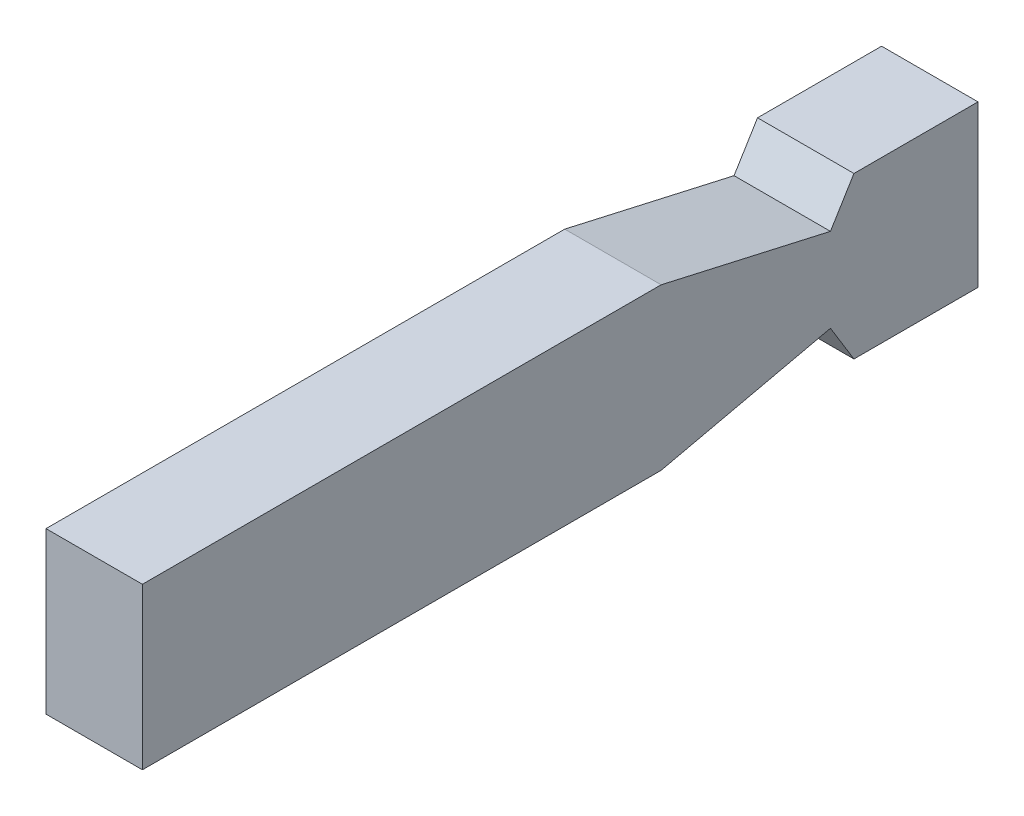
ISO-10303-21;
HEADER;
FILE_DESCRIPTION(('STEP AP214'),'2;1');
FILE_NAME('part.step','',(''),(''),'','','');
FILE_SCHEMA(('AUTOMOTIVE_DESIGN { 1 0 10303 214 1 1 1 1 }'));
ENDSEC;
DATA;
#1=APPLICATION_CONTEXT('core data for automotive mechanical design processes');
#2=APPLICATION_PROTOCOL_DEFINITION('international standard','automotive_design',2000,#1);
#3=PRODUCT_CONTEXT('',#1,'mechanical');
#4=PRODUCT('Part','Part','',(#3));
#5=PRODUCT_RELATED_PRODUCT_CATEGORY('part','',(#4));
#6=PRODUCT_DEFINITION_FORMATION('','',#4);
#7=PRODUCT_DEFINITION_CONTEXT('part definition',#1,'design');
#8=PRODUCT_DEFINITION('design','',#6,#7);
#9=PRODUCT_DEFINITION_SHAPE('','',#8);
#10=(LENGTH_UNIT() NAMED_UNIT(*) SI_UNIT(.MILLI.,.METRE.));
#11=(NAMED_UNIT(*) PLANE_ANGLE_UNIT() SI_UNIT($,.RADIAN.));
#12=(NAMED_UNIT(*) SI_UNIT($,.STERADIAN.) SOLID_ANGLE_UNIT());
#13=UNCERTAINTY_MEASURE_WITH_UNIT(LENGTH_MEASURE(1.E-05),#10,'distance_accuracy_value','');
#14=(GEOMETRIC_REPRESENTATION_CONTEXT(3) GLOBAL_UNCERTAINTY_ASSIGNED_CONTEXT((#13)) GLOBAL_UNIT_ASSIGNED_CONTEXT((#10,
#11,#12)) REPRESENTATION_CONTEXT('',''));
#15=CARTESIAN_POINT('',(0.,0.,0.));
#16=DIRECTION('',(0.,0.,1.));
#17=DIRECTION('',(1.,0.,0.));
#18=AXIS2_PLACEMENT_3D('',#15,#16,#17);
#19=CARTESIAN_POINT('',(0.,0.,130.));
#20=DIRECTION('',(0.,1.,0.));
#21=DIRECTION('',(0.,0.,1.));
#22=AXIS2_PLACEMENT_3D('',#19,#20,#21);
#23=PLANE('',#22);
#24=DIRECTION('',(0.,0.,-1.));
#25=VECTOR('',#24,1.);
#26=CARTESIAN_POINT('',(15.,0.,130.));
#27=LINE('',#26,#25);
#28=CARTESIAN_POINT('',(15.,0.,19.3));
#29=VERTEX_POINT('',#28);
#30=CARTESIAN_POINT('',(15.,0.,0.));
#31=VERTEX_POINT('',#30);
#32=EDGE_CURVE('E150',#29,#31,#27,.T.);
#33=ORIENTED_EDGE('',*,*,#32,.F.);
#34=DIRECTION('',(-1.,0.,0.));
#35=VECTOR('',#34,1.);
#36=CARTESIAN_POINT('',(15.,0.,19.3));
#37=LINE('',#36,#35);
#38=CARTESIAN_POINT('',(0.,0.,19.3));
#39=VERTEX_POINT('',#38);
#40=EDGE_CURVE('E186',#29,#39,#37,.T.);
#41=ORIENTED_EDGE('',*,*,#40,.T.);
#42=DIRECTION('',(0.,0.,-1.));
#43=VECTOR('',#42,1.);
#44=CARTESIAN_POINT('',(0.,0.,130.));
#45=LINE('',#44,#43);
#46=CARTESIAN_POINT('',(0.,0.,0.));
#47=VERTEX_POINT('',#46);
#48=EDGE_CURVE('E34',#39,#47,#45,.T.);
#49=ORIENTED_EDGE('',*,*,#48,.T.);
#50=DIRECTION('',(1.,0.,0.));
#51=VECTOR('',#50,1.);
#52=CARTESIAN_POINT('',(0.,0.,0.));
#53=LINE('',#52,#51);
#54=EDGE_CURVE('E162',#47,#31,#53,.T.);
#55=ORIENTED_EDGE('',*,*,#54,.T.);
#56=EDGE_LOOP('',(#33,#41,#49,#55));
#57=FACE_BOUND('',#56,.T.);
#58=ADVANCED_FACE('F26',(#57),#23,.F.);
#59=CARTESIAN_POINT('',(0.,25.,130.));
#60=DIRECTION('',(0.,-1.,0.));
#61=DIRECTION('',(0.,0.,-1.));
#62=AXIS2_PLACEMENT_3D('',#59,#60,#61);
#63=PLANE('',#62);
#64=DIRECTION('',(0.,0.,-1.));
#65=VECTOR('',#64,1.);
#66=CARTESIAN_POINT('',(15.,25.,130.));
#67=LINE('',#66,#65);
#68=CARTESIAN_POINT('',(15.,25.,130.));
#69=VERTEX_POINT('',#68);
#70=CARTESIAN_POINT('',(15.,25.,49.3));
#71=VERTEX_POINT('',#70);
#72=EDGE_CURVE('E148',#69,#71,#67,.T.);
#73=ORIENTED_EDGE('',*,*,#72,.T.);
#74=DIRECTION('',(-1.,0.,0.));
#75=VECTOR('',#74,1.);
#76=CARTESIAN_POINT('',(15.,25.,49.3));
#77=LINE('',#76,#75);
#78=CARTESIAN_POINT('',(0.,25.,49.3));
#79=VERTEX_POINT('',#78);
#80=EDGE_CURVE('E172',#71,#79,#77,.T.);
#81=ORIENTED_EDGE('',*,*,#80,.T.);
#82=DIRECTION('',(0.,0.,-1.));
#83=VECTOR('',#82,1.);
#84=CARTESIAN_POINT('',(0.,25.,130.));
#85=LINE('',#84,#83);
#86=CARTESIAN_POINT('',(0.,25.,130.));
#87=VERTEX_POINT('',#86);
#88=EDGE_CURVE('E145',#87,#79,#85,.T.);
#89=ORIENTED_EDGE('',*,*,#88,.F.);
#90=DIRECTION('',(-1.,0.,0.));
#91=VECTOR('',#90,1.);
#92=CARTESIAN_POINT('',(0.,25.,130.));
#93=LINE('',#92,#91);
#94=EDGE_CURVE('E132',#69,#87,#93,.T.);
#95=ORIENTED_EDGE('',*,*,#94,.F.);
#96=EDGE_LOOP('',(#73,#81,#89,#95));
#97=FACE_BOUND('',#96,.T.);
#98=ADVANCED_FACE('F202',(#97),#63,.F.);
#99=CARTESIAN_POINT('',(0.,0.,130.));
#100=DIRECTION('',(1.,0.,0.));
#101=DIRECTION('',(0.,0.,-1.));
#102=AXIS2_PLACEMENT_3D('',#99,#100,#101);
#103=PLANE('',#102);
#104=ORIENTED_EDGE('',*,*,#48,.F.);
#105=DIRECTION('',(0.,-0.852923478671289,-0.522035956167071));
#106=VECTOR('',#105,1.);
#107=CARTESIAN_POINT('',(0.,0.,19.3));
#108=LINE('',#107,#106);
#109=CARTESIAN_POINT('',(0.,5.97046435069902,22.9542516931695));
#110=VERTEX_POINT('',#109);
#111=EDGE_CURVE('E119',#110,#39,#108,.T.);
#112=ORIENTED_EDGE('',*,*,#111,.F.);
#113=DIRECTION('',(0.,0.221015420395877,-0.975270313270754));
#114=VECTOR('',#113,1.);
#115=CARTESIAN_POINT('',(0.,5.97046435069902,22.9542516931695));
#116=LINE('',#115,#114);
#117=CARTESIAN_POINT('',(0.,0.,49.3));
#118=VERTEX_POINT('',#117);
#119=EDGE_CURVE('E106',#118,#110,#116,.T.);
#120=ORIENTED_EDGE('',*,*,#119,.F.);
#121=CARTESIAN_POINT('',(0.,0.,130.));
#122=VERTEX_POINT('',#121);
#123=EDGE_CURVE('E11',#122,#118,#45,.T.);
#124=ORIENTED_EDGE('',*,*,#123,.F.);
#125=DIRECTION('',(0.,-1.,0.));
#126=VECTOR('',#125,1.);
#127=CARTESIAN_POINT('',(0.,0.,130.));
#128=LINE('',#127,#126);
#129=EDGE_CURVE('E128',#87,#122,#128,.T.);
#130=ORIENTED_EDGE('',*,*,#129,.F.);
#131=ORIENTED_EDGE('',*,*,#88,.T.);
#132=DIRECTION('',(0.,0.221015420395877,0.975270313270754));
#133=VECTOR('',#132,1.);
#134=CARTESIAN_POINT('',(0.,19.029535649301,22.9542516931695));
#135=LINE('',#134,#133);
#136=CARTESIAN_POINT('',(0.,19.029535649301,22.9542516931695));
#137=VERTEX_POINT('',#136);
#138=EDGE_CURVE('E185',#137,#79,#135,.T.);
#139=ORIENTED_EDGE('',*,*,#138,.F.);
#140=DIRECTION('',(0.,-0.852923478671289,0.522035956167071));
#141=VECTOR('',#140,1.);
#142=CARTESIAN_POINT('',(0.,25.,19.3));
#143=LINE('',#142,#141);
#144=CARTESIAN_POINT('',(0.,25.,19.3));
#145=VERTEX_POINT('',#144);
#146=EDGE_CURVE('E182',#145,#137,#143,.T.);
#147=ORIENTED_EDGE('',*,*,#146,.F.);
#148=CARTESIAN_POINT('',(0.,25.,0.));
#149=VERTEX_POINT('',#148);
#150=EDGE_CURVE('E144',#145,#149,#85,.T.);
#151=ORIENTED_EDGE('',*,*,#150,.T.);
#152=DIRECTION('',(0.,-1.,0.));
#153=VECTOR('',#152,1.);
#154=CARTESIAN_POINT('',(0.,0.,0.));
#155=LINE('',#154,#153);
#156=EDGE_CURVE('E166',#149,#47,#155,.T.);
#157=ORIENTED_EDGE('',*,*,#156,.T.);
#158=EDGE_LOOP('',(#104,#112,#120,#124,#130,#131,#139,#147,#151,#157));
#159=FACE_BOUND('',#158,.T.);
#160=ADVANCED_FACE('F28',(#159),#103,.F.);
#161=ORIENTED_EDGE('',*,*,#123,.T.);
#162=DIRECTION('',(-1.,0.,0.));
#163=VECTOR('',#162,1.);
#164=CARTESIAN_POINT('',(15.,0.,49.3));
#165=LINE('',#164,#163);
#166=CARTESIAN_POINT('',(15.,0.,49.3));
#167=VERTEX_POINT('',#166);
#168=EDGE_CURVE('E103',#167,#118,#165,.T.);
#169=ORIENTED_EDGE('',*,*,#168,.F.);
#170=CARTESIAN_POINT('',(15.,0.,130.));
#171=VERTEX_POINT('',#170);
#172=EDGE_CURVE('E124',#171,#167,#27,.T.);
#173=ORIENTED_EDGE('',*,*,#172,.F.);
#174=DIRECTION('',(1.,0.,0.));
#175=VECTOR('',#174,1.);
#176=CARTESIAN_POINT('',(0.,0.,130.));
#177=LINE('',#176,#175);
#178=EDGE_CURVE('E122',#122,#171,#177,.T.);
#179=ORIENTED_EDGE('',*,*,#178,.F.);
#180=EDGE_LOOP('',(#161,#169,#173,#179));
#181=FACE_BOUND('',#180,.T.);
#182=ADVANCED_FACE('F121',(#181),#23,.F.);
#183=CARTESIAN_POINT('',(15.,0.,130.));
#184=DIRECTION('',(-1.,0.,0.));
#185=DIRECTION('',(0.,0.,1.));
#186=AXIS2_PLACEMENT_3D('',#183,#184,#185);
#187=PLANE('',#186);
#188=DIRECTION('',(0.,0.221015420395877,-0.975270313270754));
#189=VECTOR('',#188,1.);
#190=CARTESIAN_POINT('',(15.,5.97046435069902,22.9542516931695));
#191=LINE('',#190,#189);
#192=CARTESIAN_POINT('',(15.,5.97046435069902,22.9542516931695));
#193=VERTEX_POINT('',#192);
#194=EDGE_CURVE('E109',#167,#193,#191,.T.);
#195=ORIENTED_EDGE('',*,*,#194,.T.);
#196=DIRECTION('',(0.,-0.852923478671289,-0.522035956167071));
#197=VECTOR('',#196,1.);
#198=CARTESIAN_POINT('',(15.,0.,19.3));
#199=LINE('',#198,#197);
#200=EDGE_CURVE('E41',#193,#29,#199,.T.);
#201=ORIENTED_EDGE('',*,*,#200,.T.);
#202=ORIENTED_EDGE('',*,*,#32,.T.);
#203=DIRECTION('',(0.,1.,0.));
#204=VECTOR('',#203,1.);
#205=CARTESIAN_POINT('',(15.,0.,0.));
#206=LINE('',#205,#204);
#207=CARTESIAN_POINT('',(15.,25.,0.));
#208=VERTEX_POINT('',#207);
#209=EDGE_CURVE('E138',#31,#208,#206,.T.);
#210=ORIENTED_EDGE('',*,*,#209,.T.);
#211=CARTESIAN_POINT('',(15.,25.,19.3));
#212=VERTEX_POINT('',#211);
#213=EDGE_CURVE('E147',#212,#208,#67,.T.);
#214=ORIENTED_EDGE('',*,*,#213,.F.);
#215=DIRECTION('',(0.,-0.852923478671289,0.522035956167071));
#216=VECTOR('',#215,1.);
#217=CARTESIAN_POINT('',(15.,25.,19.3));
#218=LINE('',#217,#216);
#219=CARTESIAN_POINT('',(15.,19.029535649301,22.9542516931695));
#220=VERTEX_POINT('',#219);
#221=EDGE_CURVE('E49',#212,#220,#218,.T.);
#222=ORIENTED_EDGE('',*,*,#221,.T.);
#223=DIRECTION('',(0.,0.221015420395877,0.975270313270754));
#224=VECTOR('',#223,1.);
#225=CARTESIAN_POINT('',(15.,19.029535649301,22.9542516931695));
#226=LINE('',#225,#224);
#227=EDGE_CURVE('E179',#220,#71,#226,.T.);
#228=ORIENTED_EDGE('',*,*,#227,.T.);
#229=ORIENTED_EDGE('',*,*,#72,.F.);
#230=DIRECTION('',(0.,1.,0.));
#231=VECTOR('',#230,1.);
#232=CARTESIAN_POINT('',(15.,0.,130.));
#233=LINE('',#232,#231);
#234=EDGE_CURVE('E127',#171,#69,#233,.T.);
#235=ORIENTED_EDGE('',*,*,#234,.F.);
#236=ORIENTED_EDGE('',*,*,#172,.T.);
#237=EDGE_LOOP('',(#195,#201,#202,#210,#214,#222,#228,#229,#235,#236));
#238=FACE_BOUND('',#237,.T.);
#239=ADVANCED_FACE('F155',(#238),#187,.F.);
#240=ORIENTED_EDGE('',*,*,#150,.F.);
#241=DIRECTION('',(-1.,0.,0.));
#242=VECTOR('',#241,1.);
#243=CARTESIAN_POINT('',(15.,25.,19.3));
#244=LINE('',#243,#242);
#245=EDGE_CURVE('E175',#212,#145,#244,.T.);
#246=ORIENTED_EDGE('',*,*,#245,.F.);
#247=ORIENTED_EDGE('',*,*,#213,.T.);
#248=DIRECTION('',(-1.,0.,0.));
#249=VECTOR('',#248,1.);
#250=CARTESIAN_POINT('',(0.,25.,0.));
#251=LINE('',#250,#249);
#252=EDGE_CURVE('E135',#208,#149,#251,.T.);
#253=ORIENTED_EDGE('',*,*,#252,.T.);
#254=EDGE_LOOP('',(#240,#246,#247,#253));
#255=FACE_BOUND('',#254,.T.);
#256=ADVANCED_FACE('F197',(#255),#63,.F.);
#257=CARTESIAN_POINT('',(0.,25.,130.));
#258=DIRECTION('',(0.,0.,-1.));
#259=DIRECTION('',(-1.,0.,0.));
#260=AXIS2_PLACEMENT_3D('',#257,#258,#259);
#261=PLANE('',#260);
#262=ORIENTED_EDGE('',*,*,#129,.T.);
#263=ORIENTED_EDGE('',*,*,#178,.T.);
#264=ORIENTED_EDGE('',*,*,#234,.T.);
#265=ORIENTED_EDGE('',*,*,#94,.T.);
#266=EDGE_LOOP('',(#262,#263,#264,#265));
#267=FACE_BOUND('',#266,.T.);
#268=ADVANCED_FACE('F130',(#267),#261,.F.);
#269=CARTESIAN_POINT('',(0.,25.,0.));
#270=DIRECTION('',(0.,0.,-1.));
#271=DIRECTION('',(-1.,0.,0.));
#272=AXIS2_PLACEMENT_3D('',#269,#270,#271);
#273=PLANE('',#272);
#274=ORIENTED_EDGE('',*,*,#156,.F.);
#275=ORIENTED_EDGE('',*,*,#252,.F.);
#276=ORIENTED_EDGE('',*,*,#209,.F.);
#277=ORIENTED_EDGE('',*,*,#54,.F.);
#278=EDGE_LOOP('',(#274,#275,#276,#277));
#279=FACE_BOUND('',#278,.T.);
#280=ADVANCED_FACE('F168',(#279),#273,.T.);
#281=CARTESIAN_POINT('',(15.,19.029535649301,22.9542516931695));
#282=DIRECTION('',(0.,-0.975270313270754,0.221015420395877));
#283=DIRECTION('',(0.,-0.221015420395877,-0.975270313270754));
#284=AXIS2_PLACEMENT_3D('',#281,#282,#283);
#285=PLANE('',#284);
#286=ORIENTED_EDGE('',*,*,#138,.T.);
#287=ORIENTED_EDGE('',*,*,#80,.F.);
#288=ORIENTED_EDGE('',*,*,#227,.F.);
#289=DIRECTION('',(-1.,0.,0.));
#290=VECTOR('',#289,1.);
#291=CARTESIAN_POINT('',(15.,19.029535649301,22.9542516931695));
#292=LINE('',#291,#290);
#293=EDGE_CURVE('E171',#220,#137,#292,.T.);
#294=ORIENTED_EDGE('',*,*,#293,.T.);
#295=EDGE_LOOP('',(#286,#287,#288,#294));
#296=FACE_BOUND('',#295,.T.);
#297=ADVANCED_FACE('F203',(#296),#285,.F.);
#298=CARTESIAN_POINT('',(15.,25.,19.3));
#299=DIRECTION('',(0.,-0.522035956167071,-0.852923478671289));
#300=DIRECTION('',(0.,0.852923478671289,-0.522035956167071));
#301=AXIS2_PLACEMENT_3D('',#298,#299,#300);
#302=PLANE('',#301);
#303=ORIENTED_EDGE('',*,*,#146,.T.);
#304=ORIENTED_EDGE('',*,*,#293,.F.);
#305=ORIENTED_EDGE('',*,*,#221,.F.);
#306=ORIENTED_EDGE('',*,*,#245,.T.);
#307=EDGE_LOOP('',(#303,#304,#305,#306));
#308=FACE_BOUND('',#307,.T.);
#309=ADVANCED_FACE('F204',(#308),#302,.F.);
#310=CARTESIAN_POINT('',(15.,0.,19.3));
#311=DIRECTION('',(0.,0.522035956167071,-0.852923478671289));
#312=DIRECTION('',(0.,0.852923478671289,0.522035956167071));
#313=AXIS2_PLACEMENT_3D('',#310,#311,#312);
#314=PLANE('',#313);
#315=ORIENTED_EDGE('',*,*,#111,.T.);
#316=ORIENTED_EDGE('',*,*,#40,.F.);
#317=ORIENTED_EDGE('',*,*,#200,.F.);
#318=DIRECTION('',(-1.,0.,0.));
#319=VECTOR('',#318,1.);
#320=CARTESIAN_POINT('',(15.,5.97046435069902,22.9542516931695));
#321=LINE('',#320,#319);
#322=EDGE_CURVE('E113',#193,#110,#321,.T.);
#323=ORIENTED_EDGE('',*,*,#322,.T.);
#324=EDGE_LOOP('',(#315,#316,#317,#323));
#325=FACE_BOUND('',#324,.T.);
#326=ADVANCED_FACE('F192',(#325),#314,.F.);
#327=CARTESIAN_POINT('',(15.,5.97046435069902,22.9542516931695));
#328=DIRECTION('',(0.,0.975270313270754,0.221015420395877));
#329=DIRECTION('',(0.,-0.221015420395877,0.975270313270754));
#330=AXIS2_PLACEMENT_3D('',#327,#328,#329);
#331=PLANE('',#330);
#332=ORIENTED_EDGE('',*,*,#119,.T.);
#333=ORIENTED_EDGE('',*,*,#322,.F.);
#334=ORIENTED_EDGE('',*,*,#194,.F.);
#335=ORIENTED_EDGE('',*,*,#168,.T.);
#336=EDGE_LOOP('',(#332,#333,#334,#335));
#337=FACE_BOUND('',#336,.T.);
#338=ADVANCED_FACE('F105',(#337),#331,.F.);
#339=CLOSED_SHELL('',(#58,#98,#160,#182,#239,#256,#268,#280,#297,#309,#326,#338));
#340=MANIFOLD_SOLID_BREP('B2',#339);
#341=ADVANCED_BREP_SHAPE_REPRESENTATION('',(#18,#340),#14);
#342=SHAPE_DEFINITION_REPRESENTATION(#9,#341);
ENDSEC;
END-ISO-10303-21;
